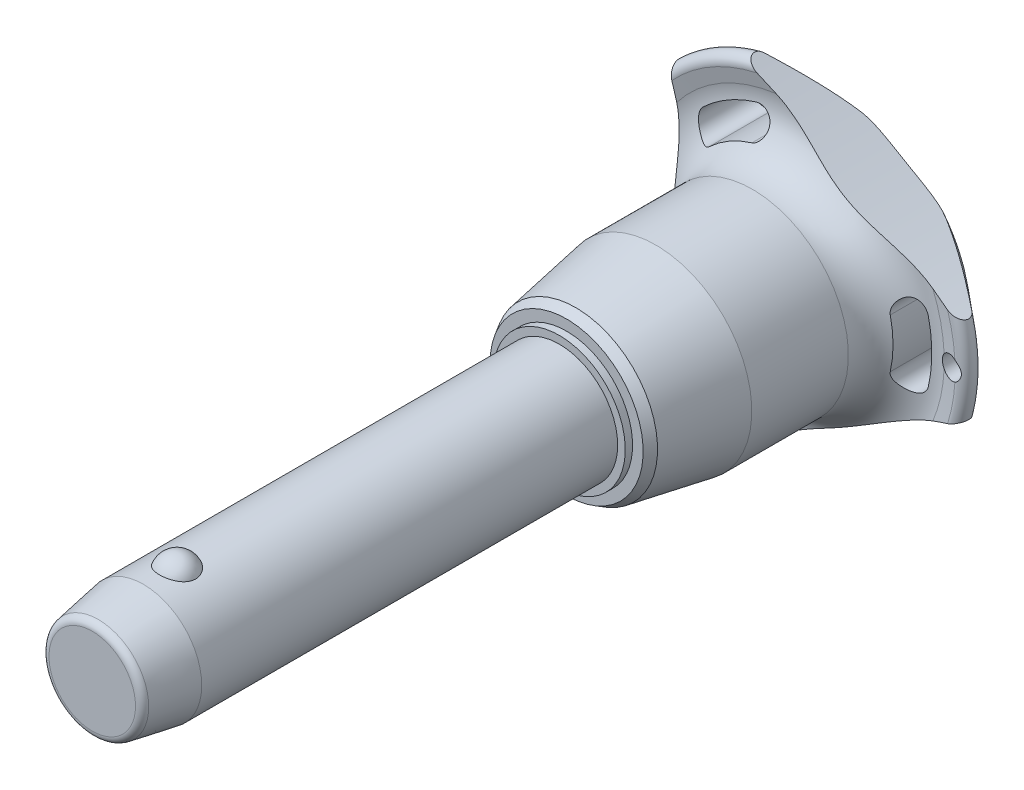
from build123d import *

# Parameters (mm, degrees)
SKETCH1_R           = 8
BOSS_EXTRUDE1_DEPTH = 50
SKETCH2_R           = 7
BOSS_EXTRUDE2_DEPTH = 39.7
BOSS_EXTRUDE3_START = 14
SKETCH1_2_R         = 8
BOSS_EXTRUDE3_DEPTH = 14
CHAMFER1_SIZE       = 7
CHAMFER1_SIZE2      = 1.234288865
FILLET1_R           = 1
SKETCH6_R           = 144.275
CUT_EXTRUDE1_DEPTH  = 96.809732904
CIRPATTERN1_COUNT   = 3
SKETCH7_R           = 1.5
CUT_EXTRUDE2_DEPTH  = 96.600036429


with BuildPart() as part:
    # Sketch1 → Boss-Extrude1 (new body)
    with BuildSketch(Plane.XY):
        Circle(SKETCH1_R)
    extrude(amount=-BOSS_EXTRUDE1_DEPTH)

    # Sketch2 → Boss-Extrude2 (add)
    with BuildSketch(Plane(origin=(0, 0, -50), x_dir=(-1, 0, 0), z_dir=(0, 0, -1))):
        Circle(SKETCH2_R)
    extrude(amount=BOSS_EXTRUDE2_DEPTH)

    # Sketch3 → Revolve1 (revolve)
    with BuildSketch(Plane(origin=(0, 0, 0), x_dir=(0, 0, -1), z_dir=(1, 0, 0))):
        with BuildLine():
            Line((-2.387467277, 9.5), (-2.387467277, 4.2))
            ThreePointArc((-2.387467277, 4.2), (0.262532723, 6.85), (-2.387467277, 9.5))
        make_face()
        with BuildLine():
            Line((-2.387467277, -4.2), (-2.387467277, -9.5))
            ThreePointArc((-2.387467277, -9.5), (0.262532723, -6.85), (-2.387467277, -4.2))
        make_face()
    revolve(axis=Axis((0, -4.2, 2.387467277), (0, 1, 0)))

    # Sketch1_2 → Boss-Extrude3 (add)
    with BuildSketch(Plane.XY.offset(BOSS_EXTRUDE3_START)):
        Circle(SKETCH1_2_R)
    extrude(amount=-BOSS_EXTRUDE3_DEPTH)

    # Chamfer1
    chamfer1_edges = [part.edges().sort_by_distance(p)[0] for p in [
        (-8, 0, 14),
    ]]
    chamfer1_side = [part.faces().sort_by_distance(p)[0] for p in [
        (-8, 0, -18),
    ]]
    chamfer(chamfer1_edges, length=CHAMFER1_SIZE, length2=CHAMFER1_SIZE2, reference=chamfer1_side[0])

    # Fillet1
    fillet1_edges = [part.edges().sort_by_distance(p)[0] for p in [
        (-6.765711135, 0, 14),
        (7, 0, -89.7),
    ]]
    fillet(fillet1_edges, radius=FILLET1_R)

    # Sketch4 → Revolve2 (revolve)
    with BuildSketch(Plane(origin=(0, 0, 0), x_dir=(0, 0, -1), z_dir=(1, 0, 0)), mode=Mode.PRIVATE) as revolve2_sk:
        Polygon((50, 0), (50, 9.044607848), (51, 9.044607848), (51, 10.490707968), (52.25235944, 11.213758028), (63.233333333, 13.15), (76.466666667, 13.15), (76.466666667, 0), align=None)
    revolve(revolve2_sk.sketch.rotate(Axis((0, 0, -76.466666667), (0, 0, 1)), 90), axis=Axis((0, 0, -76.466666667), (0, 0, 1)))

    # Sketch5 → Revolve3 (revolve)
    with BuildSketch(Plane(origin=(0, 0, 0), x_dir=(0, 0, -1), z_dir=(1, 0, 0)), mode=Mode.PRIVATE) as revolve3_sk:
        with BuildLine():
            Line((82.32877039, 20.428960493), (81.910912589, 22.344207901))
            ThreePointArc((81.910912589, 22.344207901), (82.554394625, 23.677136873), (84.002586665, 23.371345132))
            Line((84.002586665, 23.371345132), (89.141488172, 17.247040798))
            ThreePointArc((89.141488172, 17.247040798), (89.7, 15.584758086), (88.978803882, 13.986322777))
            ThreePointArc((88.978803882, 13.986322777), (84.617427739, 7.589034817), (83.083333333, 0))
            Line((83.083333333, 0), (76.466666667, 0))
            Line((76.466666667, 0), (76.466666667, 13.15))
            ThreePointArc((76.466666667, 13.15), (81.139661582, 15.38660811), (82.32877039, 20.428960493))
        make_face()
    revolve(revolve3_sk.sketch.rotate(Axis((0, 0, -83.083333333), (0, 0, 1)), 90), axis=Axis((0, 0, -83.083333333), (0, 0, 1)))

    # Sketch6 → Cut-Extrude1 (cut, through all)
    with BuildSketch(Plane.XY):
        with Locations((-159.975, 0)):
            Circle(SKETCH6_R)
        with BuildLine():
            ThreePointArc((18.131206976, -4.190753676), (18.60922037, 0), (18.131206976, 4.190753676))
            ThreePointArc((18.131206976, 4.190753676), (15.94840906, 5.553949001), (14.585213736, 3.371151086))
            ThreePointArc((14.585213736, 3.371151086), (14.969740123, 0), (14.585213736, -3.371151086))
            ThreePointArc((14.585213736, -3.371151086), (15.94840906, -5.553949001), (18.131206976, -4.190753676))
        make_face()
    cut_extrude1 = extrude(amount=-CUT_EXTRUDE1_DEPTH, mode=Mode.SUBTRACT)

    # CirPattern1: Cut-Extrude1 ×3 about axis
    cirpattern1_axis = Axis((0, 0, 0), (0, 0, 1))
    for i in range(1, CIRPATTERN1_COUNT):
        add(cut_extrude1.rotate(cirpattern1_axis, i * 360 / CIRPATTERN1_COUNT), mode=Mode.SUBTRACT)

    # Sketch7 → Cut-Extrude2 (cut, through all)
    with BuildSketch(Plane.XY):
        with Locations(Location((21.60922037, 0, 0), (0, 0, 297.620773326))):
            Circle(SKETCH7_R)
    extrude(amount=-CUT_EXTRUDE2_DEPTH, mode=Mode.SUBTRACT)


solid = part.part
